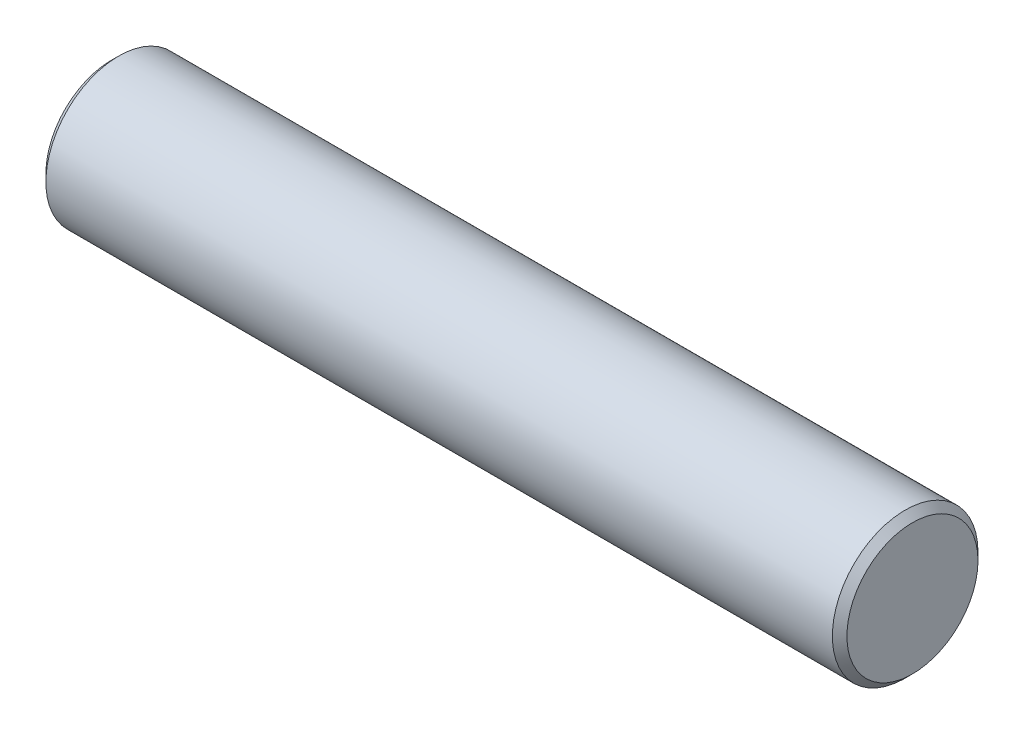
ISO-10303-21;
HEADER;
FILE_DESCRIPTION(('STEP AP214'),'2;1');
FILE_NAME('part.step','',(''),(''),'','','');
FILE_SCHEMA(('AUTOMOTIVE_DESIGN { 1 0 10303 214 1 1 1 1 }'));
ENDSEC;
DATA;
#1=APPLICATION_CONTEXT('core data for automotive mechanical design processes');
#2=APPLICATION_PROTOCOL_DEFINITION('international standard','automotive_design',2000,#1);
#3=PRODUCT_CONTEXT('',#1,'mechanical');
#4=PRODUCT('Part','Part','',(#3));
#5=PRODUCT_RELATED_PRODUCT_CATEGORY('part','',(#4));
#6=PRODUCT_DEFINITION_FORMATION('','',#4);
#7=PRODUCT_DEFINITION_CONTEXT('part definition',#1,'design');
#8=PRODUCT_DEFINITION('design','',#6,#7);
#9=PRODUCT_DEFINITION_SHAPE('','',#8);
#10=(LENGTH_UNIT() NAMED_UNIT(*) SI_UNIT(.MILLI.,.METRE.));
#11=(NAMED_UNIT(*) PLANE_ANGLE_UNIT() SI_UNIT($,.RADIAN.));
#12=(NAMED_UNIT(*) SI_UNIT($,.STERADIAN.) SOLID_ANGLE_UNIT());
#13=UNCERTAINTY_MEASURE_WITH_UNIT(LENGTH_MEASURE(1.E-05),#10,'distance_accuracy_value','');
#14=(GEOMETRIC_REPRESENTATION_CONTEXT(3) GLOBAL_UNCERTAINTY_ASSIGNED_CONTEXT((#13)) GLOBAL_UNIT_ASSIGNED_CONTEXT((#10,
#11,#12)) REPRESENTATION_CONTEXT('',''));
#15=CARTESIAN_POINT('',(0.,0.,0.));
#16=DIRECTION('',(0.,0.,1.));
#17=DIRECTION('',(1.,0.,0.));
#18=AXIS2_PLACEMENT_3D('',#15,#16,#17);
#19=CARTESIAN_POINT('',(27.5,0.,0.));
#20=DIRECTION('',(-1.,0.,0.));
#21=DIRECTION('',(0.,0.,1.));
#22=AXIS2_PLACEMENT_3D('',#19,#20,#21);
#23=CYLINDRICAL_SURFACE('',#22,5.);
#24=CARTESIAN_POINT('',(-27.,0.,0.));
#25=DIRECTION('',(1.,0.,0.));
#26=DIRECTION('',(0.,0.,-1.));
#27=AXIS2_PLACEMENT_3D('',#24,#25,#26);
#28=CIRCLE('',#27,5.);
#29=CARTESIAN_POINT('',(-27.,0.,-5.));
#30=VERTEX_POINT('',#29);
#31=EDGE_CURVE('E40',#30,#30,#28,.T.);
#32=ORIENTED_EDGE('',*,*,#31,.T.);
#33=EDGE_LOOP('',(#32));
#34=FACE_BOUND('',#33,.T.);
#35=CARTESIAN_POINT('',(27.,0.,0.));
#36=DIRECTION('',(1.,0.,0.));
#37=DIRECTION('',(0.,0.,-1.));
#38=AXIS2_PLACEMENT_3D('',#35,#36,#37);
#39=CIRCLE('',#38,5.);
#40=CARTESIAN_POINT('',(27.,0.,-5.));
#41=VERTEX_POINT('',#40);
#42=EDGE_CURVE('E44',#41,#41,#39,.F.);
#43=ORIENTED_EDGE('',*,*,#42,.T.);
#44=EDGE_LOOP('',(#43));
#45=FACE_BOUND('',#44,.T.);
#46=ADVANCED_FACE('F29',(#34,#45),#23,.T.);
#47=CARTESIAN_POINT('',(27.5,0.,0.));
#48=DIRECTION('',(1.,0.,0.));
#49=DIRECTION('',(0.,0.,-1.));
#50=AXIS2_PLACEMENT_3D('',#47,#48,#49);
#51=PLANE('',#50);
#52=CARTESIAN_POINT('',(27.5,0.,0.));
#53=DIRECTION('',(1.,0.,0.));
#54=DIRECTION('',(0.,0.,-1.));
#55=AXIS2_PLACEMENT_3D('',#52,#53,#54);
#56=CIRCLE('',#55,4.5);
#57=CARTESIAN_POINT('',(27.5,0.,-4.5));
#58=VERTEX_POINT('',#57);
#59=EDGE_CURVE('E10',#58,#58,#56,.T.);
#60=ORIENTED_EDGE('',*,*,#59,.T.);
#61=EDGE_LOOP('',(#60));
#62=FACE_BOUND('',#61,.T.);
#63=ADVANCED_FACE('F60',(#62),#51,.T.);
#64=CARTESIAN_POINT('',(-27.5,0.,0.));
#65=DIRECTION('',(1.,0.,0.));
#66=DIRECTION('',(0.,0.,-1.));
#67=AXIS2_PLACEMENT_3D('',#64,#65,#66);
#68=PLANE('',#67);
#69=CARTESIAN_POINT('',(-27.5,0.,0.));
#70=DIRECTION('',(1.,0.,0.));
#71=DIRECTION('',(0.,0.,-1.));
#72=AXIS2_PLACEMENT_3D('',#69,#70,#71);
#73=CIRCLE('',#72,4.49999999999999);
#74=CARTESIAN_POINT('',(-27.5,0.,-4.49999999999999));
#75=VERTEX_POINT('',#74);
#76=EDGE_CURVE('E36',#75,#75,#73,.F.);
#77=ORIENTED_EDGE('',*,*,#76,.T.);
#78=EDGE_LOOP('',(#77));
#79=FACE_BOUND('',#78,.T.);
#80=ADVANCED_FACE('F57',(#79),#68,.F.);
#81=CARTESIAN_POINT('',(-27.,0.,0.));
#82=DIRECTION('',(1.,0.,0.));
#83=DIRECTION('',(0.,0.,-1.));
#84=AXIS2_PLACEMENT_3D('',#81,#82,#83);
#85=CONICAL_SURFACE('',#84,5.,0.785398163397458);
#86=ORIENTED_EDGE('',*,*,#76,.F.);
#87=EDGE_LOOP('',(#86));
#88=FACE_BOUND('',#87,.T.);
#89=ORIENTED_EDGE('',*,*,#31,.F.);
#90=EDGE_LOOP('',(#89));
#91=FACE_BOUND('',#90,.T.);
#92=ADVANCED_FACE('F53',(#88,#91),#85,.T.);
#93=CARTESIAN_POINT('',(27.5,0.,0.));
#94=DIRECTION('',(-1.,0.,0.));
#95=DIRECTION('',(0.,0.,1.));
#96=AXIS2_PLACEMENT_3D('',#93,#94,#95);
#97=CONICAL_SURFACE('',#96,4.5,0.785398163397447);
#98=ORIENTED_EDGE('',*,*,#42,.F.);
#99=EDGE_LOOP('',(#98));
#100=FACE_BOUND('',#99,.T.);
#101=ORIENTED_EDGE('',*,*,#59,.F.);
#102=EDGE_LOOP('',(#101));
#103=FACE_BOUND('',#102,.T.);
#104=ADVANCED_FACE('F31',(#100,#103),#97,.T.);
#105=CLOSED_SHELL('',(#46,#63,#80,#92,#104));
#106=MANIFOLD_SOLID_BREP('B2',#105);
#107=ADVANCED_BREP_SHAPE_REPRESENTATION('',(#18,#106),#14);
#108=SHAPE_DEFINITION_REPRESENTATION(#9,#107);
ENDSEC;
END-ISO-10303-21;
